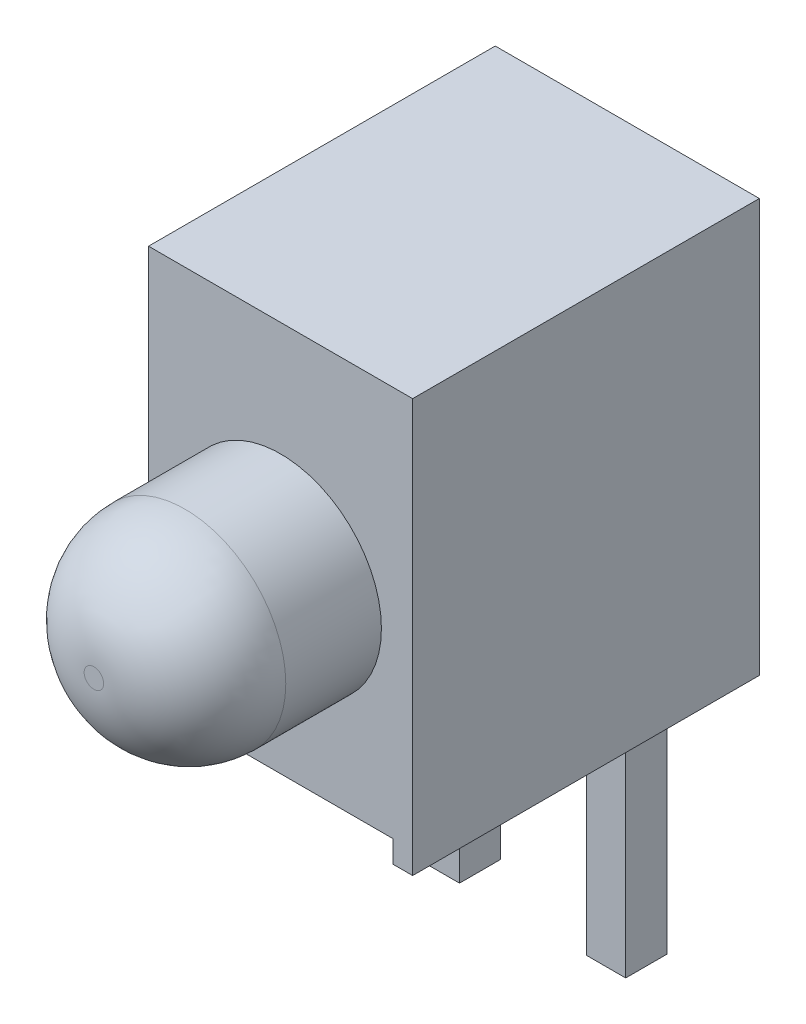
from build123d import *

# Parameters (mm, degrees)
SKETCH1_W           = 4.06
SKETCH1_H           = 5.33
BOSS_EXTRUDE1_DEPTH = 6.35
SKETCH2_R           = 1.55
BOSS_EXTRUDE2_DEPTH = 2.8702
FILLET2_R           = 1.4
SKETCH4_W           = 3.493828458
SKETCH4_H           = 0.340679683
CUT_EXTRUDE1_DEPTH  = 9.53535588
SKETCH6_W           = 0.6
SKETCH6_H           = 0.632779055
SKETCH6_H_2         = 0.632779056
BOSS_EXTRUDE5_DEPTH = 3.81


with BuildPart() as part:
    # Sketch1 → Boss-Extrude1 (new body)
    with BuildSketch(Plane(origin=(0, 0, 0), x_dir=(1, 0, 0), z_dir=(0, 1, 0))):
        Rectangle(SKETCH1_W, SKETCH1_H)
    extrude(amount=BOSS_EXTRUDE1_DEPTH)

    # Sketch2 → Boss-Extrude2 (add)
    with BuildSketch(Plane.XY.offset(2.665)):
        with Locations(Location((0, 3.05, 0), (0, 0, 180))):
            Circle(SKETCH2_R)
    extrude(amount=BOSS_EXTRUDE2_DEPTH)

    # Fillet2
    fillet2_edges = [part.edges().sort_by_distance(p)[0] for p in [
        (1.55, 3.05, 5.5352),
    ]]
    fillet(fillet2_edges, radius=FILLET2_R)

    # Sketch4 → Cut-Extrude1 (cut, through all)
    with BuildSketch(Plane.XY.offset(2.665)):
        with Locations((-0.015737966, 0.170339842)):
            Rectangle(SKETCH4_W, SKETCH4_H)
    extrude(amount=-CUT_EXTRUDE1_DEPTH, mode=Mode.SUBTRACT)

    # Sketch6 → Boss-Extrude5 (add)
    with BuildSketch(Plane.XZ.offset(-0.340679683)):
        with Locations((-1.278193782, -1.380000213)):
            Rectangle(SKETCH6_W, SKETCH6_H)
        with Locations((1.261806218, -1.395)):
            Rectangle(SKETCH6_W, SKETCH6_H_2)
    extrude(amount=BOSS_EXTRUDE5_DEPTH)


solid = part.part
